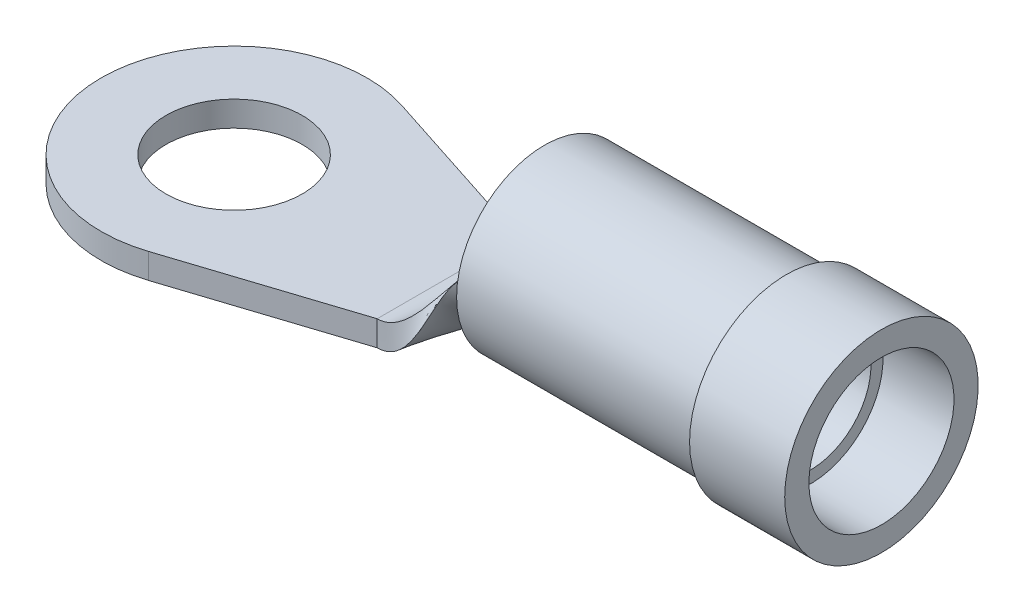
ISO-10303-21;
HEADER;
FILE_DESCRIPTION(('STEP AP214'),'2;1');
FILE_NAME('part.step','',(''),(''),'','','');
FILE_SCHEMA(('AUTOMOTIVE_DESIGN { 1 0 10303 214 1 1 1 1 }'));
ENDSEC;
DATA;
#1=APPLICATION_CONTEXT('core data for automotive mechanical design processes');
#2=APPLICATION_PROTOCOL_DEFINITION('international standard','automotive_design',2000,#1);
#3=PRODUCT_CONTEXT('',#1,'mechanical');
#4=PRODUCT('Part','Part','',(#3));
#5=PRODUCT_RELATED_PRODUCT_CATEGORY('part','',(#4));
#6=PRODUCT_DEFINITION_FORMATION('','',#4);
#7=PRODUCT_DEFINITION_CONTEXT('part definition',#1,'design');
#8=PRODUCT_DEFINITION('design','',#6,#7);
#9=PRODUCT_DEFINITION_SHAPE('','',#8);
#10=(LENGTH_UNIT() NAMED_UNIT(*) SI_UNIT(.MILLI.,.METRE.));
#11=(NAMED_UNIT(*) PLANE_ANGLE_UNIT() SI_UNIT($,.RADIAN.));
#12=(NAMED_UNIT(*) SI_UNIT($,.STERADIAN.) SOLID_ANGLE_UNIT());
#13=UNCERTAINTY_MEASURE_WITH_UNIT(LENGTH_MEASURE(1.E-05),#10,'distance_accuracy_value','');
#14=(GEOMETRIC_REPRESENTATION_CONTEXT(3) GLOBAL_UNCERTAINTY_ASSIGNED_CONTEXT((#13)) GLOBAL_UNIT_ASSIGNED_CONTEXT((#10,
#11,#12)) REPRESENTATION_CONTEXT('',''));
#15=CARTESIAN_POINT('',(0.,0.,0.));
#16=DIRECTION('',(0.,0.,1.));
#17=DIRECTION('',(1.,0.,0.));
#18=AXIS2_PLACEMENT_3D('',#15,#16,#17);
#19=CARTESIAN_POINT('',(9.779,-0.38735,0.));
#20=DIRECTION('',(-1.,0.,0.));
#21=DIRECTION('',(0.,0.,1.));
#22=AXIS2_PLACEMENT_3D('',#19,#20,#21);
#23=PLANE('',#22);
#24=CARTESIAN_POINT('',(9.779,2.38125,0.));
#25=DIRECTION('',(-1.,0.,0.));
#26=DIRECTION('',(0.,0.,1.));
#27=AXIS2_PLACEMENT_3D('',#24,#25,#26);
#28=CIRCLE('',#27,2.7686);
#29=CARTESIAN_POINT('',(9.779,2.38125,2.7686));
#30=VERTEX_POINT('',#29);
#31=EDGE_CURVE('E157',#30,#30,#28,.T.);
#32=ORIENTED_EDGE('',*,*,#31,.T.);
#33=EDGE_LOOP('',(#32));
#34=FACE_BOUND('',#33,.T.);
#35=CARTESIAN_POINT('',(9.779,2.38125,0.));
#36=DIRECTION('',(-1.,0.,0.));
#37=DIRECTION('',(0.,0.,1.));
#38=AXIS2_PLACEMENT_3D('',#35,#36,#37);
#39=CIRCLE('',#38,1.905);
#40=CARTESIAN_POINT('',(9.779,2.38125,1.905));
#41=VERTEX_POINT('',#40);
#42=EDGE_CURVE('E12',#41,#41,#39,.T.);
#43=ORIENTED_EDGE('',*,*,#42,.F.);
#44=EDGE_LOOP('',(#43));
#45=FACE_BOUND('',#44,.T.);
#46=ADVANCED_FACE('F129',(#34,#45),#23,.T.);
#47=CARTESIAN_POINT('',(5.55851083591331,2.38125,0.));
#48=DIRECTION('',(-1.,0.,0.));
#49=DIRECTION('',(0.,0.,1.));
#50=AXIS2_PLACEMENT_3D('',#47,#48,#49);
#51=CYLINDRICAL_SURFACE('',#50,1.905);
#52=ORIENTED_EDGE('',*,*,#42,.T.);
#53=EDGE_LOOP('',(#52));
#54=FACE_BOUND('',#53,.T.);
#55=CARTESIAN_POINT('',(18.161,2.38125,0.));
#56=DIRECTION('',(-1.,0.,0.));
#57=DIRECTION('',(0.,0.,1.));
#58=AXIS2_PLACEMENT_3D('',#55,#56,#57);
#59=CIRCLE('',#58,1.905);
#60=CARTESIAN_POINT('',(18.161,2.38125,1.905));
#61=VERTEX_POINT('',#60);
#62=EDGE_CURVE('E135',#61,#61,#59,.T.);
#63=ORIENTED_EDGE('',*,*,#62,.F.);
#64=EDGE_LOOP('',(#63));
#65=FACE_BOUND('',#64,.T.);
#66=ADVANCED_FACE('F175',(#54,#65),#51,.F.);
#67=CARTESIAN_POINT('',(18.161,0.0952499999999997,0.));
#68=DIRECTION('',(1.,0.,0.));
#69=DIRECTION('',(0.,0.,-1.));
#70=AXIS2_PLACEMENT_3D('',#67,#68,#69);
#71=PLANE('',#70);
#72=ORIENTED_EDGE('',*,*,#62,.T.);
#73=EDGE_LOOP('',(#72));
#74=FACE_BOUND('',#73,.T.);
#75=CARTESIAN_POINT('',(18.161,2.38125,0.));
#76=DIRECTION('',(-1.,0.,0.));
#77=DIRECTION('',(0.,0.,1.));
#78=AXIS2_PLACEMENT_3D('',#75,#76,#77);
#79=CIRCLE('',#78,2.286);
#80=CARTESIAN_POINT('',(18.161,2.38125,2.286));
#81=VERTEX_POINT('',#80);
#82=EDGE_CURVE('E139',#81,#81,#79,.T.);
#83=ORIENTED_EDGE('',*,*,#82,.F.);
#84=EDGE_LOOP('',(#83));
#85=FACE_BOUND('',#84,.T.);
#86=ADVANCED_FACE('F179',(#74,#85),#71,.T.);
#87=CARTESIAN_POINT('',(5.55851083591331,2.38125,0.));
#88=DIRECTION('',(-1.,0.,0.));
#89=DIRECTION('',(0.,0.,1.));
#90=AXIS2_PLACEMENT_3D('',#87,#88,#89);
#91=CYLINDRICAL_SURFACE('',#90,2.286);
#92=ORIENTED_EDGE('',*,*,#82,.T.);
#93=EDGE_LOOP('',(#92));
#94=FACE_BOUND('',#93,.T.);
#95=CARTESIAN_POINT('',(20.3962,2.38125,0.));
#96=DIRECTION('',(-1.,0.,0.));
#97=DIRECTION('',(0.,0.,1.));
#98=AXIS2_PLACEMENT_3D('',#95,#96,#97);
#99=CIRCLE('',#98,2.286);
#100=CARTESIAN_POINT('',(20.3962,2.38125,2.286));
#101=VERTEX_POINT('',#100);
#102=EDGE_CURVE('E143',#101,#101,#99,.T.);
#103=ORIENTED_EDGE('',*,*,#102,.F.);
#104=EDGE_LOOP('',(#103));
#105=FACE_BOUND('',#104,.T.);
#106=ADVANCED_FACE('F183',(#94,#105),#91,.F.);
#107=CARTESIAN_POINT('',(20.3962,-0.66675,0.));
#108=DIRECTION('',(1.,0.,0.));
#109=DIRECTION('',(0.,0.,-1.));
#110=AXIS2_PLACEMENT_3D('',#107,#108,#109);
#111=PLANE('',#110);
#112=ORIENTED_EDGE('',*,*,#102,.T.);
#113=EDGE_LOOP('',(#112));
#114=FACE_BOUND('',#113,.T.);
#115=CARTESIAN_POINT('',(20.3962,2.38125,0.));
#116=DIRECTION('',(-1.,0.,0.));
#117=DIRECTION('',(0.,0.,1.));
#118=AXIS2_PLACEMENT_3D('',#115,#116,#117);
#119=CIRCLE('',#118,3.048);
#120=CARTESIAN_POINT('',(20.3962,2.38125,3.048));
#121=VERTEX_POINT('',#120);
#122=EDGE_CURVE('E148',#121,#121,#119,.T.);
#123=ORIENTED_EDGE('',*,*,#122,.F.);
#124=EDGE_LOOP('',(#123));
#125=FACE_BOUND('',#124,.T.);
#126=ADVANCED_FACE('F189',(#114,#125),#111,.T.);
#127=CARTESIAN_POINT('',(5.55851083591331,2.38125,0.));
#128=DIRECTION('',(-1.,0.,0.));
#129=DIRECTION('',(0.,0.,1.));
#130=AXIS2_PLACEMENT_3D('',#127,#128,#129);
#131=CYLINDRICAL_SURFACE('',#130,3.048);
#132=ORIENTED_EDGE('',*,*,#122,.T.);
#133=EDGE_LOOP('',(#132));
#134=FACE_BOUND('',#133,.T.);
#135=CARTESIAN_POINT('',(17.399,2.38125,0.));
#136=DIRECTION('',(-1.,0.,0.));
#137=DIRECTION('',(0.,0.,1.));
#138=AXIS2_PLACEMENT_3D('',#135,#136,#137);
#139=CIRCLE('',#138,3.048);
#140=CARTESIAN_POINT('',(17.399,2.38125,3.048));
#141=VERTEX_POINT('',#140);
#142=EDGE_CURVE('E151',#141,#141,#139,.T.);
#143=ORIENTED_EDGE('',*,*,#142,.F.);
#144=EDGE_LOOP('',(#143));
#145=FACE_BOUND('',#144,.T.);
#146=ADVANCED_FACE('F171',(#134,#145),#131,.T.);
#147=CARTESIAN_POINT('',(17.399,-0.66675,0.));
#148=DIRECTION('',(-1.,0.,0.));
#149=DIRECTION('',(0.,0.,1.));
#150=AXIS2_PLACEMENT_3D('',#147,#148,#149);
#151=PLANE('',#150);
#152=ORIENTED_EDGE('',*,*,#142,.T.);
#153=EDGE_LOOP('',(#152));
#154=FACE_BOUND('',#153,.T.);
#155=CARTESIAN_POINT('',(17.399,2.38125,0.));
#156=DIRECTION('',(-1.,0.,0.));
#157=DIRECTION('',(0.,0.,1.));
#158=AXIS2_PLACEMENT_3D('',#155,#156,#157);
#159=CIRCLE('',#158,2.7686);
#160=CARTESIAN_POINT('',(17.399,2.38125,2.7686));
#161=VERTEX_POINT('',#160);
#162=EDGE_CURVE('E154',#161,#161,#159,.T.);
#163=ORIENTED_EDGE('',*,*,#162,.F.);
#164=EDGE_LOOP('',(#163));
#165=FACE_BOUND('',#164,.T.);
#166=ADVANCED_FACE('F165',(#154,#165),#151,.T.);
#167=CARTESIAN_POINT('',(5.55851083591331,2.38125,0.));
#168=DIRECTION('',(-1.,0.,0.));
#169=DIRECTION('',(0.,0.,1.));
#170=AXIS2_PLACEMENT_3D('',#167,#168,#169);
#171=CYLINDRICAL_SURFACE('',#170,2.7686);
#172=ORIENTED_EDGE('',*,*,#162,.T.);
#173=EDGE_LOOP('',(#172));
#174=FACE_BOUND('',#173,.T.);
#175=ORIENTED_EDGE('',*,*,#31,.F.);
#176=EDGE_LOOP('',(#175));
#177=FACE_BOUND('',#176,.T.);
#178=ADVANCED_FACE('F163',(#174,#177),#171,.T.);
#179=CLOSED_SHELL('',(#46,#66,#86,#106,#126,#146,#166,#178));
#180=MANIFOLD_SOLID_BREP('B2',#179);
#181=CARTESIAN_POINT('',(6.731,-0.79375,-2.2225));
#182=DIRECTION('',(0.308564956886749,0.,-0.951203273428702));
#183=DIRECTION('',(-0.951203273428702,0.,-0.308564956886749));
#184=AXIS2_PLACEMENT_3D('',#181,#182,#183);
#185=PLANE('',#184);
#186=DIRECTION('',(-0.951203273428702,0.,-0.308564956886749));
#187=VECTOR('',#186,1.);
#188=CARTESIAN_POINT('',(6.731,0.,-2.2225));
#189=LINE('',#188,#187);
#190=CARTESIAN_POINT('',(6.731,0.,-2.2225));
#191=VERTEX_POINT('',#190);
#192=CARTESIAN_POINT('',(1.29319573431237,0.,-3.98649291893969));
#193=VERTEX_POINT('',#192);
#194=EDGE_CURVE('E465',#191,#193,#189,.T.);
#195=ORIENTED_EDGE('',*,*,#194,.F.);
#196=DIRECTION('',(0.,1.,0.));
#197=VECTOR('',#196,1.);
#198=CARTESIAN_POINT('',(6.731,-0.79375,-2.2225));
#199=LINE('',#198,#197);
#200=CARTESIAN_POINT('',(6.731,-0.79375,-2.2225));
#201=VERTEX_POINT('',#200);
#202=EDGE_CURVE('E127',#201,#191,#199,.T.);
#203=ORIENTED_EDGE('',*,*,#202,.F.);
#204=DIRECTION('',(-0.951203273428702,0.,-0.308564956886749));
#205=VECTOR('',#204,1.);
#206=CARTESIAN_POINT('',(6.731,-0.79375,-2.2225));
#207=LINE('',#206,#205);
#208=CARTESIAN_POINT('',(1.29319573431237,-0.79375,-3.98649291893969));
#209=VERTEX_POINT('',#208);
#210=EDGE_CURVE('E468',#201,#209,#207,.T.);
#211=ORIENTED_EDGE('',*,*,#210,.T.);
#212=DIRECTION('',(0.,1.,0.));
#213=VECTOR('',#212,1.);
#214=CARTESIAN_POINT('',(1.29319573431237,-0.79375,-3.98649291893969));
#215=LINE('',#214,#213);
#216=EDGE_CURVE('E294',#209,#193,#215,.T.);
#217=ORIENTED_EDGE('',*,*,#216,.T.);
#218=EDGE_LOOP('',(#195,#203,#211,#217));
#219=FACE_BOUND('',#218,.T.);
#220=ADVANCED_FACE('F251',(#219),#185,.T.);
#221=CARTESIAN_POINT('',(6.731,-0.79375,2.2225));
#222=DIRECTION('',(0.308564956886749,0.,0.951203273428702));
#223=DIRECTION('',(0.951203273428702,0.,-0.308564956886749));
#224=AXIS2_PLACEMENT_3D('',#221,#222,#223);
#225=PLANE('',#224);
#226=DIRECTION('',(0.951203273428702,0.,-0.308564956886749));
#227=VECTOR('',#226,1.);
#228=CARTESIAN_POINT('',(6.731,0.,2.2225));
#229=LINE('',#228,#227);
#230=CARTESIAN_POINT('',(1.29319573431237,0.,3.98649291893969));
#231=VERTEX_POINT('',#230);
#232=CARTESIAN_POINT('',(6.731,0.,2.2225));
#233=VERTEX_POINT('',#232);
#234=EDGE_CURVE('E480',#231,#233,#229,.T.);
#235=ORIENTED_EDGE('',*,*,#234,.F.);
#236=DIRECTION('',(0.,1.,0.));
#237=VECTOR('',#236,1.);
#238=CARTESIAN_POINT('',(1.29319573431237,-0.79375,3.98649291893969));
#239=LINE('',#238,#237);
#240=CARTESIAN_POINT('',(1.29319573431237,-0.79375,3.98649291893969));
#241=VERTEX_POINT('',#240);
#242=EDGE_CURVE('E285',#241,#231,#239,.T.);
#243=ORIENTED_EDGE('',*,*,#242,.F.);
#244=DIRECTION('',(0.951203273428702,0.,-0.308564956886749));
#245=VECTOR('',#244,1.);
#246=CARTESIAN_POINT('',(6.731,-0.79375,2.2225));
#247=LINE('',#246,#245);
#248=CARTESIAN_POINT('',(6.731,-0.79375,2.2225));
#249=VERTEX_POINT('',#248);
#250=EDGE_CURVE('E472',#241,#249,#247,.T.);
#251=ORIENTED_EDGE('',*,*,#250,.T.);
#252=DIRECTION('',(0.,1.,0.));
#253=VECTOR('',#252,1.);
#254=CARTESIAN_POINT('',(6.731,-0.79375,2.2225));
#255=LINE('',#254,#253);
#256=EDGE_CURVE('E262',#249,#233,#255,.T.);
#257=ORIENTED_EDGE('',*,*,#256,.T.);
#258=EDGE_LOOP('',(#235,#243,#251,#257));
#259=FACE_BOUND('',#258,.T.);
#260=ADVANCED_FACE('F488',(#259),#225,.T.);
#261=CARTESIAN_POINT('',(0.,-0.79375,0.));
#262=DIRECTION('',(0.,1.,0.));
#263=DIRECTION('',(0.,0.,1.));
#264=AXIS2_PLACEMENT_3D('',#261,#262,#263);
#265=CYLINDRICAL_SURFACE('',#264,4.191);
#266=CARTESIAN_POINT('',(0.,0.,0.));
#267=DIRECTION('',(0.,1.,0.));
#268=DIRECTION('',(0.,0.,1.));
#269=AXIS2_PLACEMENT_3D('',#266,#267,#268);
#270=CIRCLE('',#269,4.191);
#271=EDGE_CURVE('E477',#193,#231,#270,.T.);
#272=ORIENTED_EDGE('',*,*,#271,.F.);
#273=ORIENTED_EDGE('',*,*,#216,.F.);
#274=CARTESIAN_POINT('',(0.,-0.79375,0.));
#275=DIRECTION('',(0.,1.,0.));
#276=DIRECTION('',(0.,0.,1.));
#277=AXIS2_PLACEMENT_3D('',#274,#275,#276);
#278=CIRCLE('',#277,4.191);
#279=EDGE_CURVE('E470',#209,#241,#278,.T.);
#280=ORIENTED_EDGE('',*,*,#279,.T.);
#281=ORIENTED_EDGE('',*,*,#242,.T.);
#282=EDGE_LOOP('',(#272,#273,#280,#281));
#283=FACE_BOUND('',#282,.T.);
#284=ADVANCED_FACE('F485',(#283),#265,.T.);
#285=CARTESIAN_POINT('',(0.,-0.79375,0.));
#286=DIRECTION('',(0.,1.,0.));
#287=DIRECTION('',(0.,0.,1.));
#288=AXIS2_PLACEMENT_3D('',#285,#286,#287);
#289=PLANE('',#288);
#290=CARTESIAN_POINT('',(0.,-0.79375,0.));
#291=DIRECTION('',(0.,1.,0.));
#292=DIRECTION('',(0.,0.,1.));
#293=AXIS2_PLACEMENT_3D('',#290,#291,#292);
#294=CIRCLE('',#293,2.1463);
#295=CARTESIAN_POINT('',(0.,-0.79375,2.1463));
#296=VERTEX_POINT('',#295);
#297=EDGE_CURVE('E462',#296,#296,#294,.T.);
#298=ORIENTED_EDGE('',*,*,#297,.T.);
#299=EDGE_LOOP('',(#298));
#300=FACE_BOUND('',#299,.T.);
#301=ORIENTED_EDGE('',*,*,#210,.F.);
#302=DIRECTION('',(0.,0.,-1.));
#303=VECTOR('',#302,1.);
#304=CARTESIAN_POINT('',(6.731,-0.79375,-2.2225));
#305=LINE('',#304,#303);
#306=EDGE_CURVE('E438',#249,#201,#305,.T.);
#307=ORIENTED_EDGE('',*,*,#306,.F.);
#308=ORIENTED_EDGE('',*,*,#250,.F.);
#309=ORIENTED_EDGE('',*,*,#279,.F.);
#310=EDGE_LOOP('',(#301,#307,#308,#309));
#311=FACE_BOUND('',#310,.T.);
#312=ADVANCED_FACE('F491',(#300,#311),#289,.F.);
#313=CARTESIAN_POINT('',(0.,0.,0.));
#314=DIRECTION('',(0.,1.,0.));
#315=DIRECTION('',(0.,0.,1.));
#316=AXIS2_PLACEMENT_3D('',#313,#314,#315);
#317=PLANE('',#316);
#318=CARTESIAN_POINT('',(0.,0.,0.));
#319=DIRECTION('',(0.,1.,0.));
#320=DIRECTION('',(0.,0.,1.));
#321=AXIS2_PLACEMENT_3D('',#318,#319,#320);
#322=CIRCLE('',#321,2.1463);
#323=CARTESIAN_POINT('',(0.,0.,2.1463));
#324=VERTEX_POINT('',#323);
#325=EDGE_CURVE('E443',#324,#324,#322,.T.);
#326=ORIENTED_EDGE('',*,*,#325,.F.);
#327=EDGE_LOOP('',(#326));
#328=FACE_BOUND('',#327,.T.);
#329=ORIENTED_EDGE('',*,*,#194,.T.);
#330=ORIENTED_EDGE('',*,*,#271,.T.);
#331=ORIENTED_EDGE('',*,*,#234,.T.);
#332=DIRECTION('',(0.,0.,-1.));
#333=VECTOR('',#332,1.);
#334=CARTESIAN_POINT('',(6.731,0.,-2.2225));
#335=LINE('',#334,#333);
#336=EDGE_CURVE('E418',#233,#191,#335,.T.);
#337=ORIENTED_EDGE('',*,*,#336,.T.);
#338=EDGE_LOOP('',(#329,#330,#331,#337));
#339=FACE_BOUND('',#338,.T.);
#340=ADVANCED_FACE('F487',(#328,#339),#317,.T.);
#341=CARTESIAN_POINT('',(0.,-0.79375,0.));
#342=DIRECTION('',(0.,1.,0.));
#343=DIRECTION('',(0.,0.,1.));
#344=AXIS2_PLACEMENT_3D('',#341,#342,#343);
#345=CYLINDRICAL_SURFACE('',#344,2.1463);
#346=ORIENTED_EDGE('',*,*,#297,.F.);
#347=EDGE_LOOP('',(#346));
#348=FACE_BOUND('',#347,.T.);
#349=ORIENTED_EDGE('',*,*,#325,.T.);
#350=EDGE_LOOP('',(#349));
#351=FACE_BOUND('',#350,.T.);
#352=ADVANCED_FACE('F522',(#348,#351),#345,.F.);
#353=CARTESIAN_POINT('',(9.779,2.38125,-1.905));
#354=CARTESIAN_POINT('',(8.3081070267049,2.38125,-1.905));
#355=CARTESIAN_POINT('',(8.2018929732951,-0.79375,-2.2225));
#356=CARTESIAN_POINT('',(6.731,-0.79375,-2.2225));
#357=CARTESIAN_POINT('',(9.779,-1.42874999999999,-1.905));
#358=CARTESIAN_POINT('',(8.3081070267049,-1.42874999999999,-1.905));
#359=CARTESIAN_POINT('',(8.2018929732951,-0.79375,-0.740833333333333));
#360=CARTESIAN_POINT('',(6.731,-0.79375,-0.740833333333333));
#361=CARTESIAN_POINT('',(9.779,-1.42875,1.905));
#362=CARTESIAN_POINT('',(8.3081070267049,-1.42875,1.905));
#363=CARTESIAN_POINT('',(8.2018929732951,-0.79375,0.740833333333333));
#364=CARTESIAN_POINT('',(6.731,-0.79375,0.740833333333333));
#365=CARTESIAN_POINT('',(9.779,2.38125,1.905));
#366=CARTESIAN_POINT('',(8.3081070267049,2.38125,1.905));
#367=CARTESIAN_POINT('',(8.2018929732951,-0.79375,2.2225));
#368=CARTESIAN_POINT('',(6.731,-0.79375,2.2225));
#369=(BOUNDED_SURFACE() B_SPLINE_SURFACE(3,3,((#353,#354,#355,#356),(#357,#358,#359,#360),(#361,
#362,#363,#364),(#365,#366,#367,#368)),.UNSPECIFIED.,.F.,.F.,
.F.) B_SPLINE_SURFACE_WITH_KNOTS((4,4),(4,4),(0.,1.),(0.,1.),
.UNSPECIFIED.) GEOMETRIC_REPRESENTATION_ITEM() RATIONAL_B_SPLINE_SURFACE(((1.,1.,1.,1.),
(0.333333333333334,0.333333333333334,1.,1.),(0.333333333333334,0.333333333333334,1.,1.),(1.,1.,
1.,1.))) REPRESENTATION_ITEM('') SURFACE());
#370=CARTESIAN_POINT('',(9.779,2.38125,0.));
#371=DIRECTION('',(-1.,0.,0.));
#372=DIRECTION('',(0.,0.,1.));
#373=AXIS2_PLACEMENT_3D('',#370,#371,#372);
#374=CIRCLE('',#373,1.905);
#375=CARTESIAN_POINT('',(9.779,2.38125,-1.905));
#376=VERTEX_POINT('',#375);
#377=CARTESIAN_POINT('',(9.779,2.38125,1.905));
#378=VERTEX_POINT('',#377);
#379=EDGE_CURVE('E414',#376,#378,#374,.T.);
#380=CARTESIAN_POINT('',(9.779,2.38125,1.905));
#381=CARTESIAN_POINT('',(8.3081070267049,2.38125,1.905));
#382=CARTESIAN_POINT('',(8.2018929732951,-0.79375,2.2225));
#383=CARTESIAN_POINT('',(6.731,-0.79375,2.2225));
#384=B_SPLINE_CURVE_WITH_KNOTS('',3,(#380,#381,#382,#383),.UNSPECIFIED.,.F.,.F.,(4,4),(0.,1.),.UNSPECIFIED.);
#385=EDGE_CURVE('E406',#378,#249,#384,.T.);
#386=CARTESIAN_POINT('',(9.779,2.38125,-1.905));
#387=CARTESIAN_POINT('',(8.3081070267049,2.38125,-1.905));
#388=CARTESIAN_POINT('',(8.2018929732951,-0.79375,-2.2225));
#389=CARTESIAN_POINT('',(6.731,-0.79375,-2.2225));
#390=B_SPLINE_CURVE_WITH_KNOTS('',3,(#386,#387,#388,#389),.UNSPECIFIED.,.F.,.F.,(4,4),(0.,1.),.UNSPECIFIED.);
#391=EDGE_CURVE('E419',#201,#376,#390,.F.);
#392=ORIENTED_EDGE('',*,*,#379,.T.);
#393=ORIENTED_EDGE('',*,*,#385,.T.);
#394=ORIENTED_EDGE('',*,*,#306,.T.);
#395=ORIENTED_EDGE('',*,*,#391,.T.);
#396=EDGE_LOOP('',(#392,#393,#394,#395));
#397=FACE_BOUND('',#396,.T.);
#398=ADVANCED_FACE('F436',(#397),#369,.T.);
#399=CARTESIAN_POINT('',(9.779,2.38125,1.905));
#400=CARTESIAN_POINT('',(8.3081070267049,2.38125,1.905));
#401=CARTESIAN_POINT('',(8.2018929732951,-0.79375,2.2225));
#402=CARTESIAN_POINT('',(6.731,-0.79375,2.2225));
#403=CARTESIAN_POINT('',(9.779,2.38125,1.11125));
#404=CARTESIAN_POINT('',(8.43754423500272,2.38125,1.11125));
#405=CARTESIAN_POINT('',(8.07245576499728,0.,2.2225));
#406=CARTESIAN_POINT('',(6.731,0.,2.2225));
#407=B_SPLINE_SURFACE_WITH_KNOTS('',1,3,((#399,#400,#401,#402),(#403,#404,#405,#406)),
.UNSPECIFIED.,.F.,.F.,.F.,(2,2),(4,4),(0.,1.),(0.,1.),.UNSPECIFIED.);
#408=DIRECTION('',(0.,0.,-1.));
#409=VECTOR('',#408,1.);
#410=CARTESIAN_POINT('',(9.779,2.38125,1.11125));
#411=LINE('',#410,#409);
#412=CARTESIAN_POINT('',(9.779,2.38125,1.11125));
#413=VERTEX_POINT('',#412);
#414=EDGE_CURVE('E343',#378,#413,#411,.T.);
#415=CARTESIAN_POINT('',(9.779,2.38125,1.11125));
#416=CARTESIAN_POINT('',(8.43754423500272,2.38125,1.11125));
#417=CARTESIAN_POINT('',(8.07245576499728,0.,2.2225));
#418=CARTESIAN_POINT('',(6.731,0.,2.2225));
#419=B_SPLINE_CURVE_WITH_KNOTS('',3,(#415,#416,#417,#418),.UNSPECIFIED.,.F.,.F.,(4,4),(0.,1.),.UNSPECIFIED.);
#420=EDGE_CURVE('E412',#413,#233,#419,.T.);
#421=ORIENTED_EDGE('',*,*,#414,.T.);
#422=ORIENTED_EDGE('',*,*,#420,.T.);
#423=ORIENTED_EDGE('',*,*,#256,.F.);
#424=ORIENTED_EDGE('',*,*,#385,.F.);
#425=EDGE_LOOP('',(#421,#422,#423,#424));
#426=FACE_BOUND('',#425,.T.);
#427=ADVANCED_FACE('F411',(#426),#407,.T.);
#428=CARTESIAN_POINT('',(9.779,2.38125,-1.11125));
#429=CARTESIAN_POINT('',(8.43754423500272,2.38125,-1.11125));
#430=CARTESIAN_POINT('',(8.07245576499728,0.,-2.2225));
#431=CARTESIAN_POINT('',(6.731,0.,-2.2225));
#432=CARTESIAN_POINT('',(9.779,2.38125,-1.905));
#433=CARTESIAN_POINT('',(8.3081070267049,2.38125,-1.905));
#434=CARTESIAN_POINT('',(8.2018929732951,-0.79375,-2.2225));
#435=CARTESIAN_POINT('',(6.731,-0.79375,-2.2225));
#436=B_SPLINE_SURFACE_WITH_KNOTS('',1,3,((#428,#429,#430,#431),(#432,#433,#434,#435)),
.UNSPECIFIED.,.F.,.F.,.F.,(2,2),(4,4),(0.,1.),(0.,1.),.UNSPECIFIED.);
#437=DIRECTION('',(0.,0.,-1.));
#438=VECTOR('',#437,1.);
#439=CARTESIAN_POINT('',(9.779,2.38125,-1.11125));
#440=LINE('',#439,#438);
#441=CARTESIAN_POINT('',(9.779,2.38125,-1.11125));
#442=VERTEX_POINT('',#441);
#443=EDGE_CURVE('E441',#442,#376,#440,.T.);
#444=CARTESIAN_POINT('',(9.779,2.38125,-1.11125));
#445=CARTESIAN_POINT('',(8.43754423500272,2.38125,-1.11125));
#446=CARTESIAN_POINT('',(8.07245576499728,0.,-2.2225));
#447=CARTESIAN_POINT('',(6.731,0.,-2.2225));
#448=B_SPLINE_CURVE_WITH_KNOTS('',3,(#444,#445,#446,#447),.UNSPECIFIED.,.F.,.F.,(4,4),(0.,1.),.UNSPECIFIED.);
#449=EDGE_CURVE('E420',#442,#191,#448,.T.);
#450=ORIENTED_EDGE('',*,*,#443,.T.);
#451=ORIENTED_EDGE('',*,*,#391,.F.);
#452=ORIENTED_EDGE('',*,*,#202,.T.);
#453=ORIENTED_EDGE('',*,*,#449,.F.);
#454=EDGE_LOOP('',(#450,#451,#452,#453));
#455=FACE_BOUND('',#454,.T.);
#456=ADVANCED_FACE('F493',(#455),#436,.T.);
#457=CARTESIAN_POINT('',(9.779,2.38125,1.11125));
#458=CARTESIAN_POINT('',(8.43754423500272,2.38125,1.11125));
#459=CARTESIAN_POINT('',(8.07245576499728,0.,2.2225));
#460=CARTESIAN_POINT('',(6.731,0.,2.2225));
#461=CARTESIAN_POINT('',(9.779,0.15875,1.11125));
#462=CARTESIAN_POINT('',(8.43754423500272,0.158750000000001,1.11125));
#463=CARTESIAN_POINT('',(8.07245576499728,0.,0.740833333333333));
#464=CARTESIAN_POINT('',(6.731,0.,0.740833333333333));
#465=CARTESIAN_POINT('',(9.779,0.15875,-1.11125));
#466=CARTESIAN_POINT('',(8.43754423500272,0.158750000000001,-1.11125));
#467=CARTESIAN_POINT('',(8.07245576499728,0.,-0.740833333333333));
#468=CARTESIAN_POINT('',(6.731,0.,-0.740833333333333));
#469=CARTESIAN_POINT('',(9.779,2.38125,-1.11125));
#470=CARTESIAN_POINT('',(8.43754423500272,2.38125,-1.11125));
#471=CARTESIAN_POINT('',(8.07245576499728,0.,-2.2225));
#472=CARTESIAN_POINT('',(6.731,0.,-2.2225));
#473=(BOUNDED_SURFACE() B_SPLINE_SURFACE(3,3,((#457,#458,#459,#460),(#461,#462,#463,#464),(#465,
#466,#467,#468),(#469,#470,#471,#472)),.UNSPECIFIED.,.F.,.F.,
.F.) B_SPLINE_SURFACE_WITH_KNOTS((4,4),(4,4),(0.,1.),(0.,1.),
.UNSPECIFIED.) GEOMETRIC_REPRESENTATION_ITEM() RATIONAL_B_SPLINE_SURFACE(((1.,1.,1.,1.),
(0.333333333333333,0.333333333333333,1.,1.),(0.333333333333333,0.333333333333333,1.,1.),(1.,1.,
1.,1.))) REPRESENTATION_ITEM('') SURFACE());
#474=CARTESIAN_POINT('',(9.779,2.38125,0.));
#475=DIRECTION('',(1.,0.,0.));
#476=DIRECTION('',(0.,0.,1.));
#477=AXIS2_PLACEMENT_3D('',#474,#475,#476);
#478=CIRCLE('',#477,1.11125);
#479=EDGE_CURVE('E401',#413,#442,#478,.T.);
#480=ORIENTED_EDGE('',*,*,#479,.T.);
#481=ORIENTED_EDGE('',*,*,#449,.T.);
#482=ORIENTED_EDGE('',*,*,#336,.F.);
#483=ORIENTED_EDGE('',*,*,#420,.F.);
#484=EDGE_LOOP('',(#480,#481,#482,#483));
#485=FACE_BOUND('',#484,.T.);
#486=ADVANCED_FACE('F417',(#485),#473,.T.);
#487=CARTESIAN_POINT('',(9.779,3.49144233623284,-0.0484720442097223));
#488=DIRECTION('',(-1.,0.,0.));
#489=DIRECTION('',(0.,0.,1.));
#490=AXIS2_PLACEMENT_3D('',#487,#488,#489);
#491=PLANE('',#490);
#492=ORIENTED_EDGE('',*,*,#414,.F.);
#493=CARTESIAN_POINT('',(9.779,2.38125,0.));
#494=DIRECTION('',(-1.,0.,0.));
#495=DIRECTION('',(0.,0.,1.));
#496=AXIS2_PLACEMENT_3D('',#493,#494,#495);
#497=CIRCLE('',#496,1.905);
#498=CARTESIAN_POINT('',(9.779,4.28443686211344,0.0830949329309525));
#499=VERTEX_POINT('',#498);
#500=EDGE_CURVE('E337',#378,#499,#497,.T.);
#501=ORIENTED_EDGE('',*,*,#500,.T.);
#502=DIRECTION('',(0.,0.999048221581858,0.0436193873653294));
#503=VECTOR('',#502,1.);
#504=CARTESIAN_POINT('',(9.779,3.49144233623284,0.0484720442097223));
#505=LINE('',#504,#503);
#506=CARTESIAN_POINT('',(9.779,3.49144233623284,0.0484720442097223));
#507=VERTEX_POINT('',#506);
#508=EDGE_CURVE('E340',#507,#499,#505,.T.);
#509=ORIENTED_EDGE('',*,*,#508,.F.);
#510=CARTESIAN_POINT('',(9.779,2.38125,0.));
#511=DIRECTION('',(-1.,0.,0.));
#512=DIRECTION('',(0.,0.,1.));
#513=AXIS2_PLACEMENT_3D('',#510,#511,#512);
#514=CIRCLE('',#513,1.11125);
#515=EDGE_CURVE('E378',#413,#507,#514,.T.);
#516=ORIENTED_EDGE('',*,*,#515,.F.);
#517=EDGE_LOOP('',(#492,#501,#509,#516));
#518=FACE_BOUND('',#517,.T.);
#519=ADVANCED_FACE('F339',(#518),#491,.T.);
#520=ORIENTED_EDGE('',*,*,#443,.F.);
#521=CARTESIAN_POINT('',(9.779,3.49144233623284,-0.0484720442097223));
#522=VERTEX_POINT('',#521);
#523=EDGE_CURVE('E387',#522,#442,#514,.T.);
#524=ORIENTED_EDGE('',*,*,#523,.F.);
#525=DIRECTION('',(0.,0.999048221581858,-0.0436193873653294));
#526=VECTOR('',#525,1.);
#527=CARTESIAN_POINT('',(9.779,3.49144233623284,-0.0484720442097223));
#528=LINE('',#527,#526);
#529=CARTESIAN_POINT('',(9.779,4.28443686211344,-0.0830949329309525));
#530=VERTEX_POINT('',#529);
#531=EDGE_CURVE('E367',#522,#530,#528,.T.);
#532=ORIENTED_EDGE('',*,*,#531,.T.);
#533=EDGE_CURVE('E348',#530,#376,#497,.T.);
#534=ORIENTED_EDGE('',*,*,#533,.T.);
#535=EDGE_LOOP('',(#520,#524,#532,#534));
#536=FACE_BOUND('',#535,.T.);
#537=ADVANCED_FACE('F495',(#536),#491,.T.);
#538=CARTESIAN_POINT('',(6.5460439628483,2.38125,0.));
#539=DIRECTION('',(-1.,0.,0.));
#540=DIRECTION('',(0.,0.,1.));
#541=AXIS2_PLACEMENT_3D('',#538,#539,#540);
#542=CYLINDRICAL_SURFACE('',#541,1.905);
#543=CARTESIAN_POINT('',(14.097,2.38125,0.));
#544=DIRECTION('',(-1.,0.,0.));
#545=DIRECTION('',(0.,0.,1.));
#546=AXIS2_PLACEMENT_3D('',#543,#544,#545);
#547=CIRCLE('',#546,1.905);
#548=CARTESIAN_POINT('',(14.097,4.28443686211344,-0.0830949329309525));
#549=VERTEX_POINT('',#548);
#550=CARTESIAN_POINT('',(14.097,4.28443686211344,0.0830949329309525));
#551=VERTEX_POINT('',#550);
#552=EDGE_CURVE('E349',#549,#551,#547,.T.);
#553=ORIENTED_EDGE('',*,*,#552,.T.);
#554=DIRECTION('',(1.,0.,0.));
#555=VECTOR('',#554,1.);
#556=CARTESIAN_POINT('',(9.779,4.28443686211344,0.0830949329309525));
#557=LINE('',#556,#555);
#558=EDGE_CURVE('E355',#499,#551,#557,.T.);
#559=ORIENTED_EDGE('',*,*,#558,.F.);
#560=ORIENTED_EDGE('',*,*,#500,.F.);
#561=ORIENTED_EDGE('',*,*,#379,.F.);
#562=ORIENTED_EDGE('',*,*,#533,.F.);
#563=DIRECTION('',(1.,0.,0.));
#564=VECTOR('',#563,1.);
#565=CARTESIAN_POINT('',(9.779,4.28443686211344,-0.0830949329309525));
#566=LINE('',#565,#564);
#567=EDGE_CURVE('E370',#530,#549,#566,.T.);
#568=ORIENTED_EDGE('',*,*,#567,.T.);
#569=EDGE_LOOP('',(#553,#559,#560,#561,#562,#568));
#570=FACE_BOUND('',#569,.T.);
#571=ADVANCED_FACE('F360',(#570),#542,.T.);
#572=CARTESIAN_POINT('',(14.097,4.28443686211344,-0.0830949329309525));
#573=DIRECTION('',(1.,0.,0.));
#574=DIRECTION('',(0.,0.,-1.));
#575=AXIS2_PLACEMENT_3D('',#572,#573,#574);
#576=PLANE('',#575);
#577=CARTESIAN_POINT('',(14.097,2.38125,0.));
#578=DIRECTION('',(-1.,0.,0.));
#579=DIRECTION('',(0.,0.,1.));
#580=AXIS2_PLACEMENT_3D('',#577,#578,#579);
#581=CIRCLE('',#580,1.11125);
#582=CARTESIAN_POINT('',(14.097,3.49144233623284,-0.0484720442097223));
#583=VERTEX_POINT('',#582);
#584=CARTESIAN_POINT('',(14.097,3.49144233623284,0.0484720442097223));
#585=VERTEX_POINT('',#584);
#586=EDGE_CURVE('E381',#583,#585,#581,.T.);
#587=ORIENTED_EDGE('',*,*,#586,.T.);
#588=DIRECTION('',(0.,-0.999048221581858,-0.0436193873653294));
#589=VECTOR('',#588,1.);
#590=CARTESIAN_POINT('',(14.097,4.28443686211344,0.0830949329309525));
#591=LINE('',#590,#589);
#592=EDGE_CURVE('E362',#551,#585,#591,.T.);
#593=ORIENTED_EDGE('',*,*,#592,.F.);
#594=ORIENTED_EDGE('',*,*,#552,.F.);
#595=DIRECTION('',(0.,-0.999048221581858,0.0436193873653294));
#596=VECTOR('',#595,1.);
#597=CARTESIAN_POINT('',(14.097,4.28443686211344,-0.0830949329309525));
#598=LINE('',#597,#596);
#599=EDGE_CURVE('E372',#549,#583,#598,.T.);
#600=ORIENTED_EDGE('',*,*,#599,.T.);
#601=EDGE_LOOP('',(#587,#593,#594,#600));
#602=FACE_BOUND('',#601,.T.);
#603=ADVANCED_FACE('F394',(#602),#576,.T.);
#604=CARTESIAN_POINT('',(6.5460439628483,2.38125,0.));
#605=DIRECTION('',(-1.,0.,0.));
#606=DIRECTION('',(0.,0.,1.));
#607=AXIS2_PLACEMENT_3D('',#604,#605,#606);
#608=CYLINDRICAL_SURFACE('',#607,1.11125);
#609=DIRECTION('',(-1.,0.,0.));
#610=VECTOR('',#609,1.);
#611=CARTESIAN_POINT('',(9.779,3.49144233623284,-0.0484720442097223));
#612=LINE('',#611,#610);
#613=EDGE_CURVE('E375',#583,#522,#612,.T.);
#614=ORIENTED_EDGE('',*,*,#613,.T.);
#615=ORIENTED_EDGE('',*,*,#523,.T.);
#616=ORIENTED_EDGE('',*,*,#479,.F.);
#617=ORIENTED_EDGE('',*,*,#515,.T.);
#618=DIRECTION('',(-1.,0.,0.));
#619=VECTOR('',#618,1.);
#620=CARTESIAN_POINT('',(9.779,3.49144233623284,0.0484720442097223));
#621=LINE('',#620,#619);
#622=EDGE_CURVE('E358',#585,#507,#621,.T.);
#623=ORIENTED_EDGE('',*,*,#622,.F.);
#624=ORIENTED_EDGE('',*,*,#586,.F.);
#625=EDGE_LOOP('',(#614,#615,#616,#617,#623,#624));
#626=FACE_BOUND('',#625,.T.);
#627=ADVANCED_FACE('F398',(#626),#608,.F.);
#628=CARTESIAN_POINT('',(9.779,4.28443686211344,-0.0830949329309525));
#629=DIRECTION('',(0.,-0.0436193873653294,-0.999048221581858));
#630=DIRECTION('',(1.,0.,0.));
#631=AXIS2_PLACEMENT_3D('',#628,#629,#630);
#632=PLANE('',#631);
#633=ORIENTED_EDGE('',*,*,#531,.F.);
#634=ORIENTED_EDGE('',*,*,#613,.F.);
#635=ORIENTED_EDGE('',*,*,#599,.F.);
#636=ORIENTED_EDGE('',*,*,#567,.F.);
#637=EDGE_LOOP('',(#633,#634,#635,#636));
#638=FACE_BOUND('',#637,.T.);
#639=ADVANCED_FACE('F499',(#638),#632,.F.);
#640=CARTESIAN_POINT('',(9.779,4.28443686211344,0.0830949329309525));
#641=DIRECTION('',(0.,0.0436193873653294,-0.999048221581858));
#642=DIRECTION('',(1.,0.,0.));
#643=AXIS2_PLACEMENT_3D('',#640,#641,#642);
#644=PLANE('',#643);
#645=ORIENTED_EDGE('',*,*,#508,.T.);
#646=ORIENTED_EDGE('',*,*,#558,.T.);
#647=ORIENTED_EDGE('',*,*,#592,.T.);
#648=ORIENTED_EDGE('',*,*,#622,.T.);
#649=EDGE_LOOP('',(#645,#646,#647,#648));
#650=FACE_BOUND('',#649,.T.);
#651=ADVANCED_FACE('F353',(#650),#644,.T.);
#652=CLOSED_SHELL('',(#220,#260,#284,#312,#340,#352,#398,#427,#456,#486,#519,#537,#571,#603,
#627,#639,#651));
#653=MANIFOLD_SOLID_BREP('B7',#652);
#654=ADVANCED_BREP_SHAPE_REPRESENTATION('',(#18,#180,#653),#14);
#655=SHAPE_DEFINITION_REPRESENTATION(#9,#654);
ENDSEC;
END-ISO-10303-21;
